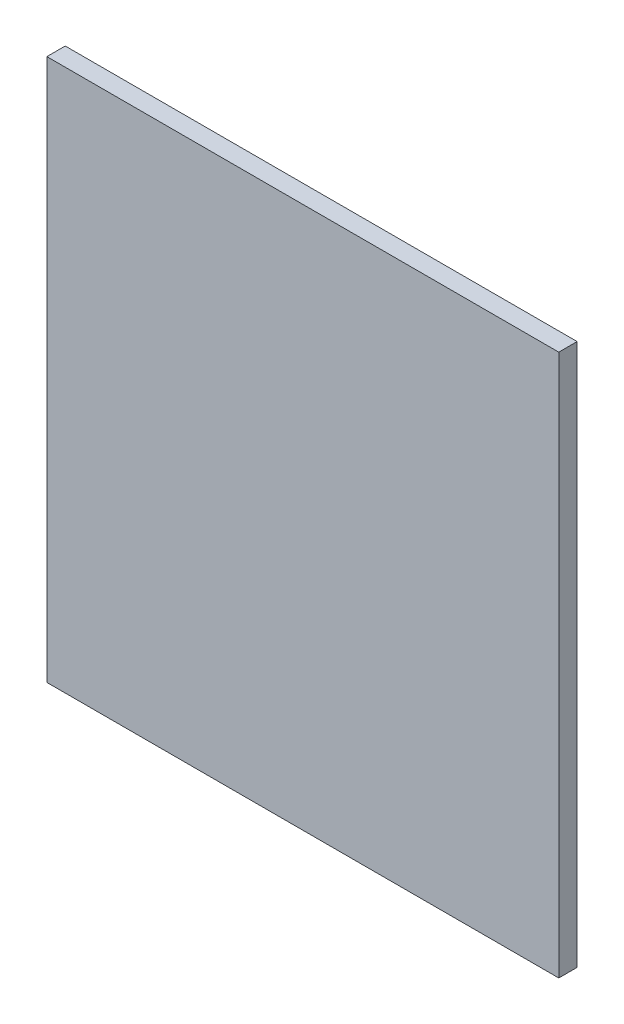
ISO-10303-21;
HEADER;
FILE_DESCRIPTION(('STEP AP214'),'2;1');
FILE_NAME('part.step','',(''),(''),'','','');
FILE_SCHEMA(('AUTOMOTIVE_DESIGN { 1 0 10303 214 1 1 1 1 }'));
ENDSEC;
DATA;
#1=APPLICATION_CONTEXT('core data for automotive mechanical design processes');
#2=APPLICATION_PROTOCOL_DEFINITION('international standard','automotive_design',2000,#1);
#3=PRODUCT_CONTEXT('',#1,'mechanical');
#4=PRODUCT('Part','Part','',(#3));
#5=PRODUCT_RELATED_PRODUCT_CATEGORY('part','',(#4));
#6=PRODUCT_DEFINITION_FORMATION('','',#4);
#7=PRODUCT_DEFINITION_CONTEXT('part definition',#1,'design');
#8=PRODUCT_DEFINITION('design','',#6,#7);
#9=PRODUCT_DEFINITION_SHAPE('','',#8);
#10=(LENGTH_UNIT() NAMED_UNIT(*) SI_UNIT(.MILLI.,.METRE.));
#11=(NAMED_UNIT(*) PLANE_ANGLE_UNIT() SI_UNIT($,.RADIAN.));
#12=(NAMED_UNIT(*) SI_UNIT($,.STERADIAN.) SOLID_ANGLE_UNIT());
#13=UNCERTAINTY_MEASURE_WITH_UNIT(LENGTH_MEASURE(1.E-05),#10,'distance_accuracy_value','');
#14=(GEOMETRIC_REPRESENTATION_CONTEXT(3) GLOBAL_UNCERTAINTY_ASSIGNED_CONTEXT((#13)) GLOBAL_UNIT_ASSIGNED_CONTEXT((#10,
#11,#12)) REPRESENTATION_CONTEXT('',''));
#15=CARTESIAN_POINT('',(0.,0.,0.));
#16=DIRECTION('',(0.,0.,1.));
#17=DIRECTION('',(1.,0.,0.));
#18=AXIS2_PLACEMENT_3D('',#15,#16,#17);
#19=CARTESIAN_POINT('',(8.975,18.75,-0.03048));
#20=DIRECTION('',(0.,-1.,0.));
#21=DIRECTION('',(0.,0.,-1.));
#22=AXIS2_PLACEMENT_3D('',#19,#20,#21);
#23=PLANE('',#22);
#24=DIRECTION('',(1.,0.,0.));
#25=VECTOR('',#24,1.);
#26=CARTESIAN_POINT('',(9.4,18.75,0.));
#27=LINE('',#26,#25);
#28=CARTESIAN_POINT('',(8.975,18.75,0.));
#29=VERTEX_POINT('',#28);
#30=CARTESIAN_POINT('',(9.825,18.75,0.));
#31=VERTEX_POINT('',#30);
#32=EDGE_CURVE('E74',#29,#31,#27,.T.);
#33=ORIENTED_EDGE('',*,*,#32,.T.);
#34=DIRECTION('',(0.,0.,-1.));
#35=VECTOR('',#34,1.);
#36=CARTESIAN_POINT('',(9.825,18.75,-0.01524));
#37=LINE('',#36,#35);
#38=CARTESIAN_POINT('',(9.825,18.75,-0.03048));
#39=VERTEX_POINT('',#38);
#40=EDGE_CURVE('E103',#31,#39,#37,.T.);
#41=ORIENTED_EDGE('',*,*,#40,.T.);
#42=DIRECTION('',(1.,0.,0.));
#43=VECTOR('',#42,1.);
#44=CARTESIAN_POINT('',(8.975,18.75,-0.03048));
#45=LINE('',#44,#43);
#46=CARTESIAN_POINT('',(8.975,18.75,-0.03048));
#47=VERTEX_POINT('',#46);
#48=EDGE_CURVE('E76',#47,#39,#45,.T.);
#49=ORIENTED_EDGE('',*,*,#48,.F.);
#50=DIRECTION('',(0.,0.,-1.));
#51=VECTOR('',#50,1.);
#52=CARTESIAN_POINT('',(8.975,18.75,-0.01524));
#53=LINE('',#52,#51);
#54=EDGE_CURVE('E11',#29,#47,#53,.T.);
#55=ORIENTED_EDGE('',*,*,#54,.F.);
#56=EDGE_LOOP('',(#33,#41,#49,#55));
#57=FACE_BOUND('',#56,.T.);
#58=ADVANCED_FACE('F17',(#57),#23,.F.);
#59=CARTESIAN_POINT('',(8.975,17.85,-0.03048));
#60=DIRECTION('',(1.,0.,0.));
#61=DIRECTION('',(0.,1.,0.));
#62=AXIS2_PLACEMENT_3D('',#59,#60,#61);
#63=PLANE('',#62);
#64=DIRECTION('',(0.,1.,0.));
#65=VECTOR('',#64,1.);
#66=CARTESIAN_POINT('',(8.975,18.3,0.));
#67=LINE('',#66,#65);
#68=CARTESIAN_POINT('',(8.975,17.85,0.));
#69=VERTEX_POINT('',#68);
#70=EDGE_CURVE('E80',#69,#29,#67,.T.);
#71=ORIENTED_EDGE('',*,*,#70,.T.);
#72=ORIENTED_EDGE('',*,*,#54,.T.);
#73=DIRECTION('',(0.,1.,0.));
#74=VECTOR('',#73,1.);
#75=CARTESIAN_POINT('',(8.975,17.85,-0.03048));
#76=LINE('',#75,#74);
#77=CARTESIAN_POINT('',(8.975,17.85,-0.03048));
#78=VERTEX_POINT('',#77);
#79=EDGE_CURVE('E104',#78,#47,#76,.T.);
#80=ORIENTED_EDGE('',*,*,#79,.F.);
#81=DIRECTION('',(0.,0.,-1.));
#82=VECTOR('',#81,1.);
#83=CARTESIAN_POINT('',(8.975,17.85,-0.01524));
#84=LINE('',#83,#82);
#85=EDGE_CURVE('E20',#69,#78,#84,.T.);
#86=ORIENTED_EDGE('',*,*,#85,.F.);
#87=EDGE_LOOP('',(#71,#72,#80,#86));
#88=FACE_BOUND('',#87,.T.);
#89=ADVANCED_FACE('F81',(#88),#63,.F.);
#90=CARTESIAN_POINT('',(9.825,17.85,-0.03048));
#91=DIRECTION('',(0.,1.,0.));
#92=DIRECTION('',(1.,0.,0.));
#93=AXIS2_PLACEMENT_3D('',#90,#91,#92);
#94=PLANE('',#93);
#95=DIRECTION('',(-1.,0.,0.));
#96=VECTOR('',#95,1.);
#97=CARTESIAN_POINT('',(9.4,17.85,0.));
#98=LINE('',#97,#96);
#99=CARTESIAN_POINT('',(9.825,17.85,0.));
#100=VERTEX_POINT('',#99);
#101=EDGE_CURVE('E85',#100,#69,#98,.T.);
#102=ORIENTED_EDGE('',*,*,#101,.T.);
#103=ORIENTED_EDGE('',*,*,#85,.T.);
#104=DIRECTION('',(-1.,0.,0.));
#105=VECTOR('',#104,1.);
#106=CARTESIAN_POINT('',(9.825,17.85,-0.03048));
#107=LINE('',#106,#105);
#108=CARTESIAN_POINT('',(9.825,17.85,-0.03048));
#109=VERTEX_POINT('',#108);
#110=EDGE_CURVE('E108',#109,#78,#107,.T.);
#111=ORIENTED_EDGE('',*,*,#110,.F.);
#112=DIRECTION('',(0.,0.,-1.));
#113=VECTOR('',#112,1.);
#114=CARTESIAN_POINT('',(9.825,17.85,-0.01524));
#115=LINE('',#114,#113);
#116=EDGE_CURVE('E47',#100,#109,#115,.T.);
#117=ORIENTED_EDGE('',*,*,#116,.F.);
#118=EDGE_LOOP('',(#102,#103,#111,#117));
#119=FACE_BOUND('',#118,.T.);
#120=ADVANCED_FACE('F142',(#119),#94,.F.);
#121=CARTESIAN_POINT('',(9.825,18.75,-0.03048));
#122=DIRECTION('',(-1.,0.,0.));
#123=DIRECTION('',(0.,0.,1.));
#124=AXIS2_PLACEMENT_3D('',#121,#122,#123);
#125=PLANE('',#124);
#126=DIRECTION('',(0.,-1.,0.));
#127=VECTOR('',#126,1.);
#128=CARTESIAN_POINT('',(9.825,18.3,0.));
#129=LINE('',#128,#127);
#130=EDGE_CURVE('E89',#31,#100,#129,.T.);
#131=ORIENTED_EDGE('',*,*,#130,.T.);
#132=ORIENTED_EDGE('',*,*,#116,.T.);
#133=DIRECTION('',(0.,-1.,0.));
#134=VECTOR('',#133,1.);
#135=CARTESIAN_POINT('',(9.825,18.75,-0.03048));
#136=LINE('',#135,#134);
#137=EDGE_CURVE('E98',#39,#109,#136,.T.);
#138=ORIENTED_EDGE('',*,*,#137,.F.);
#139=ORIENTED_EDGE('',*,*,#40,.F.);
#140=EDGE_LOOP('',(#131,#132,#138,#139));
#141=FACE_BOUND('',#140,.T.);
#142=ADVANCED_FACE('F133',(#141),#125,.F.);
#143=CARTESIAN_POINT('',(9.4,18.3,-0.03048));
#144=DIRECTION('',(0.,0.,1.));
#145=DIRECTION('',(1.,0.,0.));
#146=AXIS2_PLACEMENT_3D('',#143,#144,#145);
#147=PLANE('',#146);
#148=ORIENTED_EDGE('',*,*,#48,.T.);
#149=ORIENTED_EDGE('',*,*,#137,.T.);
#150=ORIENTED_EDGE('',*,*,#110,.T.);
#151=ORIENTED_EDGE('',*,*,#79,.T.);
#152=EDGE_LOOP('',(#148,#149,#150,#151));
#153=FACE_BOUND('',#152,.T.);
#154=ADVANCED_FACE('F124',(#153),#147,.F.);
#155=CARTESIAN_POINT('',(9.4,18.3,0.));
#156=DIRECTION('',(0.,0.,1.));
#157=DIRECTION('',(1.,0.,0.));
#158=AXIS2_PLACEMENT_3D('',#155,#156,#157);
#159=PLANE('',#158);
#160=ORIENTED_EDGE('',*,*,#32,.F.);
#161=ORIENTED_EDGE('',*,*,#70,.F.);
#162=ORIENTED_EDGE('',*,*,#101,.F.);
#163=ORIENTED_EDGE('',*,*,#130,.F.);
#164=EDGE_LOOP('',(#160,#161,#162,#163));
#165=FACE_BOUND('',#164,.T.);
#166=ADVANCED_FACE('F88',(#165),#159,.T.);
#167=CLOSED_SHELL('',(#58,#89,#120,#142,#154,#166));
#168=MANIFOLD_SOLID_BREP('B1',#167);
#169=ADVANCED_BREP_SHAPE_REPRESENTATION('',(#18,#168),#14);
#170=SHAPE_DEFINITION_REPRESENTATION(#9,#169);
ENDSEC;
END-ISO-10303-21;
